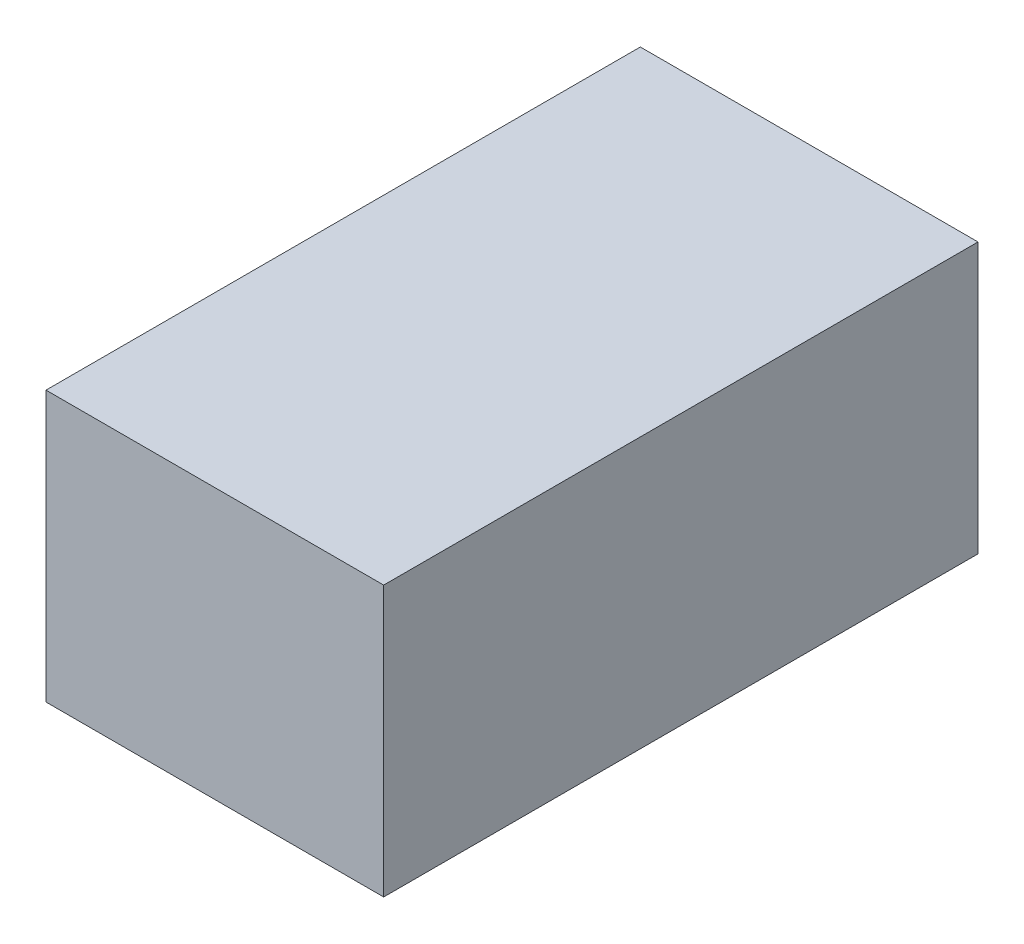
ISO-10303-21;
HEADER;
FILE_DESCRIPTION(('STEP AP214'),'2;1');
FILE_NAME('part.step','',(''),(''),'','','');
FILE_SCHEMA(('AUTOMOTIVE_DESIGN { 1 0 10303 214 1 1 1 1 }'));
ENDSEC;
DATA;
#1=APPLICATION_CONTEXT('core data for automotive mechanical design processes');
#2=APPLICATION_PROTOCOL_DEFINITION('international standard','automotive_design',2000,#1);
#3=PRODUCT_CONTEXT('',#1,'mechanical');
#4=PRODUCT('Part','Part','',(#3));
#5=PRODUCT_RELATED_PRODUCT_CATEGORY('part','',(#4));
#6=PRODUCT_DEFINITION_FORMATION('','',#4);
#7=PRODUCT_DEFINITION_CONTEXT('part definition',#1,'design');
#8=PRODUCT_DEFINITION('design','',#6,#7);
#9=PRODUCT_DEFINITION_SHAPE('','',#8);
#10=(LENGTH_UNIT() NAMED_UNIT(*) SI_UNIT(.MILLI.,.METRE.));
#11=(NAMED_UNIT(*) PLANE_ANGLE_UNIT() SI_UNIT($,.RADIAN.));
#12=(NAMED_UNIT(*) SI_UNIT($,.STERADIAN.) SOLID_ANGLE_UNIT());
#13=UNCERTAINTY_MEASURE_WITH_UNIT(LENGTH_MEASURE(1.E-05),#10,'distance_accuracy_value','');
#14=(GEOMETRIC_REPRESENTATION_CONTEXT(3) GLOBAL_UNCERTAINTY_ASSIGNED_CONTEXT((#13)) GLOBAL_UNIT_ASSIGNED_CONTEXT((#10,
#11,#12)) REPRESENTATION_CONTEXT('',''));
#15=CARTESIAN_POINT('',(0.,0.,0.));
#16=DIRECTION('',(0.,0.,1.));
#17=DIRECTION('',(1.,0.,0.));
#18=AXIS2_PLACEMENT_3D('',#15,#16,#17);
#19=CARTESIAN_POINT('',(-0.625,1.,1.1));
#20=DIRECTION('',(1.,0.,0.));
#21=DIRECTION('',(0.,0.,-1.));
#22=AXIS2_PLACEMENT_3D('',#19,#20,#21);
#23=PLANE('',#22);
#24=DIRECTION('',(0.,0.,1.));
#25=VECTOR('',#24,1.);
#26=CARTESIAN_POINT('',(-0.625,0.,1.1));
#27=LINE('',#26,#25);
#28=CARTESIAN_POINT('',(-0.625,0.,-1.1));
#29=VERTEX_POINT('',#28);
#30=CARTESIAN_POINT('',(-0.625,0.,1.1));
#31=VERTEX_POINT('',#30);
#32=EDGE_CURVE('E95',#29,#31,#27,.T.);
#33=ORIENTED_EDGE('',*,*,#32,.T.);
#34=DIRECTION('',(0.,-1.,0.));
#35=VECTOR('',#34,1.);
#36=CARTESIAN_POINT('',(-0.625,1.,1.1));
#37=LINE('',#36,#35);
#38=CARTESIAN_POINT('',(-0.625,1.,1.1));
#39=VERTEX_POINT('',#38);
#40=EDGE_CURVE('E11',#39,#31,#37,.T.);
#41=ORIENTED_EDGE('',*,*,#40,.F.);
#42=DIRECTION('',(0.,0.,1.));
#43=VECTOR('',#42,1.);
#44=CARTESIAN_POINT('',(-0.625,1.,1.1));
#45=LINE('',#44,#43);
#46=CARTESIAN_POINT('',(-0.625,1.,-1.1));
#47=VERTEX_POINT('',#46);
#48=EDGE_CURVE('E83',#47,#39,#45,.T.);
#49=ORIENTED_EDGE('',*,*,#48,.F.);
#50=DIRECTION('',(0.,-1.,0.));
#51=VECTOR('',#50,1.);
#52=CARTESIAN_POINT('',(-0.625,1.,-1.1));
#53=LINE('',#52,#51);
#54=EDGE_CURVE('E91',#47,#29,#53,.T.);
#55=ORIENTED_EDGE('',*,*,#54,.T.);
#56=EDGE_LOOP('',(#33,#41,#49,#55));
#57=FACE_BOUND('',#56,.T.);
#58=ADVANCED_FACE('F32',(#57),#23,.F.);
#59=CARTESIAN_POINT('',(0.625,1.,1.1));
#60=DIRECTION('',(0.,0.,-1.));
#61=DIRECTION('',(-1.,0.,0.));
#62=AXIS2_PLACEMENT_3D('',#59,#60,#61);
#63=PLANE('',#62);
#64=DIRECTION('',(1.,0.,0.));
#65=VECTOR('',#64,1.);
#66=CARTESIAN_POINT('',(0.625,0.,1.1));
#67=LINE('',#66,#65);
#68=CARTESIAN_POINT('',(0.625,0.,1.1));
#69=VERTEX_POINT('',#68);
#70=EDGE_CURVE('E87',#31,#69,#67,.T.);
#71=ORIENTED_EDGE('',*,*,#70,.T.);
#72=DIRECTION('',(0.,-1.,0.));
#73=VECTOR('',#72,1.);
#74=CARTESIAN_POINT('',(0.625,1.,1.1));
#75=LINE('',#74,#73);
#76=CARTESIAN_POINT('',(0.625,1.,1.1));
#77=VERTEX_POINT('',#76);
#78=EDGE_CURVE('E40',#77,#69,#75,.T.);
#79=ORIENTED_EDGE('',*,*,#78,.F.);
#80=DIRECTION('',(1.,0.,0.));
#81=VECTOR('',#80,1.);
#82=CARTESIAN_POINT('',(0.625,1.,1.1));
#83=LINE('',#82,#81);
#84=EDGE_CURVE('E78',#39,#77,#83,.T.);
#85=ORIENTED_EDGE('',*,*,#84,.F.);
#86=ORIENTED_EDGE('',*,*,#40,.T.);
#87=EDGE_LOOP('',(#71,#79,#85,#86));
#88=FACE_BOUND('',#87,.T.);
#89=ADVANCED_FACE('F86',(#88),#63,.F.);
#90=CARTESIAN_POINT('',(0.625,1.,1.1));
#91=DIRECTION('',(-1.,0.,0.));
#92=DIRECTION('',(0.,0.,1.));
#93=AXIS2_PLACEMENT_3D('',#90,#91,#92);
#94=PLANE('',#93);
#95=DIRECTION('',(0.,0.,-1.));
#96=VECTOR('',#95,1.);
#97=CARTESIAN_POINT('',(0.625,0.,1.1));
#98=LINE('',#97,#96);
#99=CARTESIAN_POINT('',(0.625,0.,-1.1));
#100=VERTEX_POINT('',#99);
#101=EDGE_CURVE('E65',#69,#100,#98,.T.);
#102=ORIENTED_EDGE('',*,*,#101,.T.);
#103=DIRECTION('',(0.,-1.,0.));
#104=VECTOR('',#103,1.);
#105=CARTESIAN_POINT('',(0.625,1.,-1.1));
#106=LINE('',#105,#104);
#107=CARTESIAN_POINT('',(0.625,1.,-1.1));
#108=VERTEX_POINT('',#107);
#109=EDGE_CURVE('E88',#108,#100,#106,.T.);
#110=ORIENTED_EDGE('',*,*,#109,.F.);
#111=DIRECTION('',(0.,0.,-1.));
#112=VECTOR('',#111,1.);
#113=CARTESIAN_POINT('',(0.625,1.,1.1));
#114=LINE('',#113,#112);
#115=EDGE_CURVE('E81',#77,#108,#114,.T.);
#116=ORIENTED_EDGE('',*,*,#115,.F.);
#117=ORIENTED_EDGE('',*,*,#78,.T.);
#118=EDGE_LOOP('',(#102,#110,#116,#117));
#119=FACE_BOUND('',#118,.T.);
#120=ADVANCED_FACE('F89',(#119),#94,.F.);
#121=CARTESIAN_POINT('',(0.625,1.,-1.1));
#122=DIRECTION('',(0.,0.,1.));
#123=DIRECTION('',(1.,0.,0.));
#124=AXIS2_PLACEMENT_3D('',#121,#122,#123);
#125=PLANE('',#124);
#126=DIRECTION('',(-1.,0.,0.));
#127=VECTOR('',#126,1.);
#128=CARTESIAN_POINT('',(0.625,0.,-1.1));
#129=LINE('',#128,#127);
#130=EDGE_CURVE('E71',#100,#29,#129,.T.);
#131=ORIENTED_EDGE('',*,*,#130,.T.);
#132=ORIENTED_EDGE('',*,*,#54,.F.);
#133=DIRECTION('',(-1.,0.,0.));
#134=VECTOR('',#133,1.);
#135=CARTESIAN_POINT('',(0.625,1.,-1.1));
#136=LINE('',#135,#134);
#137=EDGE_CURVE('E48',#108,#47,#136,.T.);
#138=ORIENTED_EDGE('',*,*,#137,.F.);
#139=ORIENTED_EDGE('',*,*,#109,.T.);
#140=EDGE_LOOP('',(#131,#132,#138,#139));
#141=FACE_BOUND('',#140,.T.);
#142=ADVANCED_FACE('F102',(#141),#125,.F.);
#143=CARTESIAN_POINT('',(0.,1.,0.));
#144=DIRECTION('',(0.,1.,0.));
#145=DIRECTION('',(0.,0.,1.));
#146=AXIS2_PLACEMENT_3D('',#143,#144,#145);
#147=PLANE('',#146);
#148=ORIENTED_EDGE('',*,*,#48,.T.);
#149=ORIENTED_EDGE('',*,*,#84,.T.);
#150=ORIENTED_EDGE('',*,*,#115,.T.);
#151=ORIENTED_EDGE('',*,*,#137,.T.);
#152=EDGE_LOOP('',(#148,#149,#150,#151));
#153=FACE_BOUND('',#152,.T.);
#154=ADVANCED_FACE('F79',(#153),#147,.T.);
#155=CARTESIAN_POINT('',(0.,0.,0.));
#156=DIRECTION('',(0.,1.,0.));
#157=DIRECTION('',(0.,0.,1.));
#158=AXIS2_PLACEMENT_3D('',#155,#156,#157);
#159=PLANE('',#158);
#160=ORIENTED_EDGE('',*,*,#32,.F.);
#161=ORIENTED_EDGE('',*,*,#130,.F.);
#162=ORIENTED_EDGE('',*,*,#101,.F.);
#163=ORIENTED_EDGE('',*,*,#70,.F.);
#164=EDGE_LOOP('',(#160,#161,#162,#163));
#165=FACE_BOUND('',#164,.T.);
#166=ADVANCED_FACE('F105',(#165),#159,.F.);
#167=CLOSED_SHELL('',(#58,#89,#120,#142,#154,#166));
#168=MANIFOLD_SOLID_BREP('B2',#167);
#169=ADVANCED_BREP_SHAPE_REPRESENTATION('',(#18,#168),#14);
#170=SHAPE_DEFINITION_REPRESENTATION(#9,#169);
ENDSEC;
END-ISO-10303-21;
